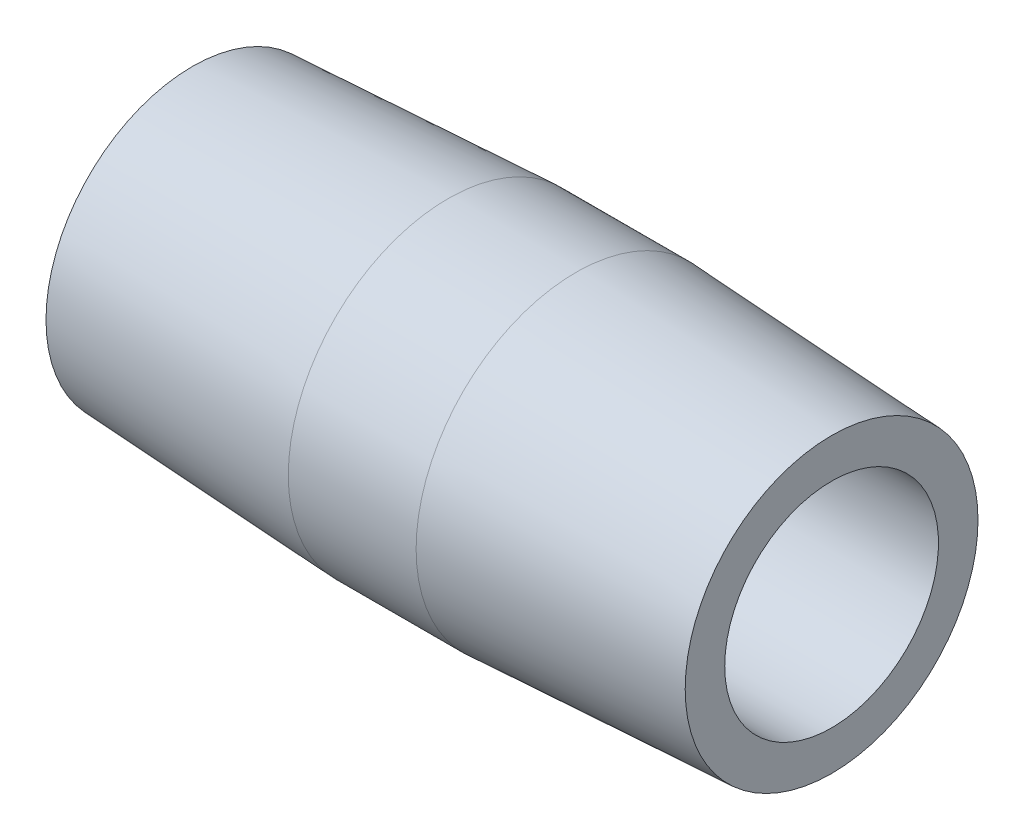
ISO-10303-21;
HEADER;
FILE_DESCRIPTION(('STEP AP214'),'2;1');
FILE_NAME('part.step','',(''),(''),'','','');
FILE_SCHEMA(('AUTOMOTIVE_DESIGN { 1 0 10303 214 1 1 1 1 }'));
ENDSEC;
DATA;
#1=APPLICATION_CONTEXT('core data for automotive mechanical design processes');
#2=APPLICATION_PROTOCOL_DEFINITION('international standard','automotive_design',2000,#1);
#3=PRODUCT_CONTEXT('',#1,'mechanical');
#4=PRODUCT('Part','Part','',(#3));
#5=PRODUCT_RELATED_PRODUCT_CATEGORY('part','',(#4));
#6=PRODUCT_DEFINITION_FORMATION('','',#4);
#7=PRODUCT_DEFINITION_CONTEXT('part definition',#1,'design');
#8=PRODUCT_DEFINITION('design','',#6,#7);
#9=PRODUCT_DEFINITION_SHAPE('','',#8);
#10=(LENGTH_UNIT() NAMED_UNIT(*) SI_UNIT(.MILLI.,.METRE.));
#11=(NAMED_UNIT(*) PLANE_ANGLE_UNIT() SI_UNIT($,.RADIAN.));
#12=(NAMED_UNIT(*) SI_UNIT($,.STERADIAN.) SOLID_ANGLE_UNIT());
#13=UNCERTAINTY_MEASURE_WITH_UNIT(LENGTH_MEASURE(1.E-05),#10,'distance_accuracy_value','');
#14=(GEOMETRIC_REPRESENTATION_CONTEXT(3) GLOBAL_UNCERTAINTY_ASSIGNED_CONTEXT((#13)) GLOBAL_UNIT_ASSIGNED_CONTEXT((#10,
#11,#12)) REPRESENTATION_CONTEXT('',''));
#15=CARTESIAN_POINT('',(0.,0.,0.));
#16=DIRECTION('',(0.,0.,1.));
#17=DIRECTION('',(1.,0.,0.));
#18=AXIS2_PLACEMENT_3D('',#15,#16,#17);
#19=CARTESIAN_POINT('',(0.476141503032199,0.,0.));
#20=DIRECTION('',(-1.,0.,0.));
#21=DIRECTION('',(0.,0.,1.));
#22=AXIS2_PLACEMENT_3D('',#19,#20,#21);
#23=CYLINDRICAL_SURFACE('',#22,3.96875);
#24=CARTESIAN_POINT('',(6.35,0.,0.));
#25=DIRECTION('',(-1.,0.,0.));
#26=DIRECTION('',(0.,0.,1.));
#27=AXIS2_PLACEMENT_3D('',#24,#25,#26);
#28=CIRCLE('',#27,3.96875);
#29=CARTESIAN_POINT('',(6.35,0.,3.96875));
#30=VERTEX_POINT('',#29);
#31=EDGE_CURVE('E10',#30,#30,#28,.T.);
#32=ORIENTED_EDGE('',*,*,#31,.F.);
#33=EDGE_LOOP('',(#32));
#34=FACE_BOUND('',#33,.T.);
#35=CARTESIAN_POINT('',(9.525,0.,0.));
#36=DIRECTION('',(-1.,0.,0.));
#37=DIRECTION('',(0.,0.,1.));
#38=AXIS2_PLACEMENT_3D('',#35,#36,#37);
#39=CIRCLE('',#38,3.96875);
#40=CARTESIAN_POINT('',(9.525,0.,3.96875));
#41=VERTEX_POINT('',#40);
#42=EDGE_CURVE('E52',#41,#41,#39,.T.);
#43=ORIENTED_EDGE('',*,*,#42,.T.);
#44=EDGE_LOOP('',(#43));
#45=FACE_BOUND('',#44,.T.);
#46=ADVANCED_FACE('F30',(#34,#45),#23,.T.);
#47=CARTESIAN_POINT('',(6.35,0.,0.));
#48=DIRECTION('',(1.,0.,0.));
#49=DIRECTION('',(0.,0.,-1.));
#50=AXIS2_PLACEMENT_3D('',#47,#48,#49);
#51=CONICAL_SURFACE('',#50,3.96875,0.0523598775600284);
#52=CARTESIAN_POINT('',(0.,0.,0.));
#53=DIRECTION('',(-1.,0.,0.));
#54=DIRECTION('',(0.,0.,1.));
#55=AXIS2_PLACEMENT_3D('',#52,#53,#54);
#56=CIRCLE('',#55,3.63596060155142);
#57=CARTESIAN_POINT('',(0.,0.,3.63596060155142));
#58=VERTEX_POINT('',#57);
#59=EDGE_CURVE('E36',#58,#58,#56,.T.);
#60=ORIENTED_EDGE('',*,*,#59,.F.);
#61=EDGE_LOOP('',(#60));
#62=FACE_BOUND('',#61,.T.);
#63=ORIENTED_EDGE('',*,*,#31,.T.);
#64=EDGE_LOOP('',(#63));
#65=FACE_BOUND('',#64,.T.);
#66=ADVANCED_FACE('F77',(#62,#65),#51,.T.);
#67=CARTESIAN_POINT('',(0.,3.63596060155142,0.));
#68=DIRECTION('',(1.,0.,0.));
#69=DIRECTION('',(0.,0.,-1.));
#70=AXIS2_PLACEMENT_3D('',#67,#68,#69);
#71=PLANE('',#70);
#72=CARTESIAN_POINT('',(0.,0.,0.));
#73=DIRECTION('',(-1.,0.,0.));
#74=DIRECTION('',(0.,0.,1.));
#75=AXIS2_PLACEMENT_3D('',#72,#73,#74);
#76=CIRCLE('',#75,2.65429999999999);
#77=CARTESIAN_POINT('',(0.,0.,2.65429999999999));
#78=VERTEX_POINT('',#77);
#79=EDGE_CURVE('E40',#78,#78,#76,.T.);
#80=ORIENTED_EDGE('',*,*,#79,.F.);
#81=EDGE_LOOP('',(#80));
#82=FACE_BOUND('',#81,.T.);
#83=ORIENTED_EDGE('',*,*,#59,.T.);
#84=EDGE_LOOP('',(#83));
#85=FACE_BOUND('',#84,.T.);
#86=ADVANCED_FACE('F72',(#82,#85),#71,.F.);
#87=CARTESIAN_POINT('',(0.476141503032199,0.,0.));
#88=DIRECTION('',(-1.,0.,0.));
#89=DIRECTION('',(0.,0.,1.));
#90=AXIS2_PLACEMENT_3D('',#87,#88,#89);
#91=CYLINDRICAL_SURFACE('',#90,2.6543);
#92=CARTESIAN_POINT('',(15.875,0.,0.));
#93=DIRECTION('',(-1.,0.,0.));
#94=DIRECTION('',(0.,0.,1.));
#95=AXIS2_PLACEMENT_3D('',#92,#93,#94);
#96=CIRCLE('',#95,2.6543);
#97=CARTESIAN_POINT('',(15.875,0.,2.6543));
#98=VERTEX_POINT('',#97);
#99=EDGE_CURVE('E44',#98,#98,#96,.T.);
#100=ORIENTED_EDGE('',*,*,#99,.F.);
#101=EDGE_LOOP('',(#100));
#102=FACE_BOUND('',#101,.T.);
#103=ORIENTED_EDGE('',*,*,#79,.T.);
#104=EDGE_LOOP('',(#103));
#105=FACE_BOUND('',#104,.T.);
#106=ADVANCED_FACE('F66',(#102,#105),#91,.F.);
#107=CARTESIAN_POINT('',(15.875,2.6543,0.));
#108=DIRECTION('',(-1.,0.,0.));
#109=DIRECTION('',(0.,0.,1.));
#110=AXIS2_PLACEMENT_3D('',#107,#108,#109);
#111=PLANE('',#110);
#112=CARTESIAN_POINT('',(15.875,0.,0.));
#113=DIRECTION('',(-1.,0.,0.));
#114=DIRECTION('',(0.,0.,1.));
#115=AXIS2_PLACEMENT_3D('',#112,#113,#114);
#116=CIRCLE('',#115,3.63596060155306);
#117=CARTESIAN_POINT('',(15.875,0.,3.63596060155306));
#118=VERTEX_POINT('',#117);
#119=EDGE_CURVE('E49',#118,#118,#116,.T.);
#120=ORIENTED_EDGE('',*,*,#119,.F.);
#121=EDGE_LOOP('',(#120));
#122=FACE_BOUND('',#121,.T.);
#123=ORIENTED_EDGE('',*,*,#99,.T.);
#124=EDGE_LOOP('',(#123));
#125=FACE_BOUND('',#124,.T.);
#126=ADVANCED_FACE('F60',(#122,#125),#111,.F.);
#127=CARTESIAN_POINT('',(15.875,0.,0.));
#128=DIRECTION('',(-1.,0.,0.));
#129=DIRECTION('',(0.,0.,1.));
#130=AXIS2_PLACEMENT_3D('',#127,#128,#129);
#131=CONICAL_SURFACE('',#130,3.63596060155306,0.0523598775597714);
#132=ORIENTED_EDGE('',*,*,#42,.F.);
#133=EDGE_LOOP('',(#132));
#134=FACE_BOUND('',#133,.T.);
#135=ORIENTED_EDGE('',*,*,#119,.T.);
#136=EDGE_LOOP('',(#135));
#137=FACE_BOUND('',#136,.T.);
#138=ADVANCED_FACE('F57',(#134,#137),#131,.T.);
#139=CLOSED_SHELL('',(#46,#66,#86,#106,#126,#138));
#140=MANIFOLD_SOLID_BREP('B2',#139);
#141=ADVANCED_BREP_SHAPE_REPRESENTATION('',(#18,#140),#14);
#142=SHAPE_DEFINITION_REPRESENTATION(#9,#141);
ENDSEC;
END-ISO-10303-21;
